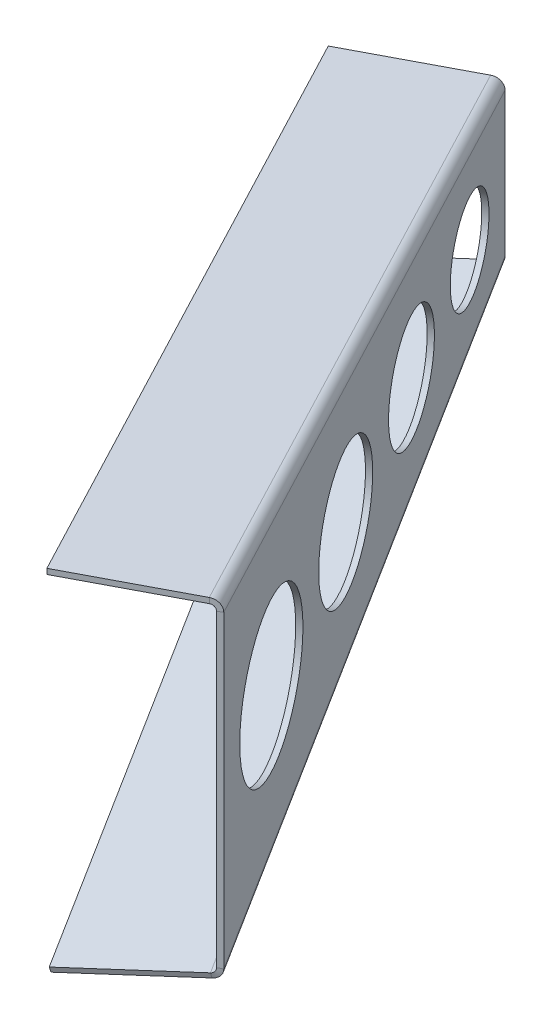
ISO-10303-21;
HEADER;
FILE_DESCRIPTION(('STEP AP214'),'2;1');
FILE_NAME('part.step','',(''),(''),'','','');
FILE_SCHEMA(('AUTOMOTIVE_DESIGN { 1 0 10303 214 1 1 1 1 }'));
ENDSEC;
DATA;
#1=APPLICATION_CONTEXT('core data for automotive mechanical design processes');
#2=APPLICATION_PROTOCOL_DEFINITION('international standard','automotive_design',2000,#1);
#3=PRODUCT_CONTEXT('',#1,'mechanical');
#4=PRODUCT('Part','Part','',(#3));
#5=PRODUCT_RELATED_PRODUCT_CATEGORY('part','',(#4));
#6=PRODUCT_DEFINITION_FORMATION('','',#4);
#7=PRODUCT_DEFINITION_CONTEXT('part definition',#1,'design');
#8=PRODUCT_DEFINITION('design','',#6,#7);
#9=PRODUCT_DEFINITION_SHAPE('','',#8);
#10=(LENGTH_UNIT() NAMED_UNIT(*) SI_UNIT(.MILLI.,.METRE.));
#11=(NAMED_UNIT(*) PLANE_ANGLE_UNIT() SI_UNIT($,.RADIAN.));
#12=(NAMED_UNIT(*) SI_UNIT($,.STERADIAN.) SOLID_ANGLE_UNIT());
#13=UNCERTAINTY_MEASURE_WITH_UNIT(LENGTH_MEASURE(1.E-05),#10,'distance_accuracy_value','');
#14=(GEOMETRIC_REPRESENTATION_CONTEXT(3) GLOBAL_UNCERTAINTY_ASSIGNED_CONTEXT((#13)) GLOBAL_UNIT_ASSIGNED_CONTEXT((#10,
#11,#12)) REPRESENTATION_CONTEXT('',''));
#15=CARTESIAN_POINT('',(0.,0.,0.));
#16=DIRECTION('',(0.,0.,1.));
#17=DIRECTION('',(1.,0.,0.));
#18=AXIS2_PLACEMENT_3D('',#15,#16,#17);
#19=CARTESIAN_POINT('',(2418.14339431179,-101.30553026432,-702.652532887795));
#20=DIRECTION('',(-0.465229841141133,0.,-0.885189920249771));
#21=DIRECTION('',(0.,1.,0.));
#22=AXIS2_PLACEMENT_3D('',#19,#20,#21);
#23=PLANE('',#22);
#24=DIRECTION('',(-0.885189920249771,0.,0.465229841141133));
#25=VECTOR('',#24,1.);
#26=CARTESIAN_POINT('',(2418.14339431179,-98.5287202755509,-702.652532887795));
#27=LINE('',#26,#25);
#28=CARTESIAN_POINT('',(2419.58235904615,-98.5287202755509,-703.408810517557));
#29=VERTEX_POINT('',#28);
#30=CARTESIAN_POINT('',(2418.14339431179,-98.5287202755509,-702.652532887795));
#31=VERTEX_POINT('',#30);
#32=EDGE_CURVE('E12',#29,#31,#27,.T.);
#33=ORIENTED_EDGE('',*,*,#32,.F.);
#34=DIRECTION('',(0.,1.,0.));
#35=VECTOR('',#34,1.);
#36=CARTESIAN_POINT('',(2419.58235904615,1.78294100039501E-12,-703.408810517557));
#37=LINE('',#36,#35);
#38=CARTESIAN_POINT('',(2419.58235904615,-4.87679999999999,-703.408810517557));
#39=VERTEX_POINT('',#38);
#40=EDGE_CURVE('E140',#29,#39,#37,.T.);
#41=ORIENTED_EDGE('',*,*,#40,.T.);
#42=DIRECTION('',(-0.885189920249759,0.,0.465229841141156));
#43=VECTOR('',#42,1.);
#44=CARTESIAN_POINT('',(2418.14339431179,-4.87679999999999,-702.652532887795));
#45=LINE('',#44,#43);
#46=CARTESIAN_POINT('',(2418.14339431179,-4.87679999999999,-702.652532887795));
#47=VERTEX_POINT('',#46);
#48=EDGE_CURVE('E93',#39,#47,#45,.T.);
#49=ORIENTED_EDGE('',*,*,#48,.T.);
#50=DIRECTION('',(0.,1.,0.));
#51=VECTOR('',#50,1.);
#52=CARTESIAN_POINT('',(2418.14339431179,-101.30553026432,-702.652532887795));
#53=LINE('',#52,#51);
#54=EDGE_CURVE('E142',#31,#47,#53,.T.);
#55=ORIENTED_EDGE('',*,*,#54,.F.);
#56=EDGE_LOOP('',(#33,#41,#49,#55));
#57=FACE_BOUND('',#56,.T.);
#58=ADVANCED_FACE('F82',(#57),#23,.F.);
#59=CARTESIAN_POINT('',(2416.70442957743,-4.87679999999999,-701.896255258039));
#60=DIRECTION('',(-0.46522984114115,0.,-0.885189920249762));
#61=DIRECTION('',(-0.885189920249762,0.,0.46522984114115));
#62=AXIS2_PLACEMENT_3D('',#59,#60,#61);
#63=PLANE('',#62);
#64=ORIENTED_EDGE('',*,*,#48,.F.);
#65=CARTESIAN_POINT('',(2416.70442957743,-4.87679999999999,-701.896255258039));
#66=DIRECTION('',(-0.465229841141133,0.,-0.885189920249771));
#67=DIRECTION('',(-0.885189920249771,0.,0.465229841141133));
#68=AXIS2_PLACEMENT_3D('',#65,#66,#67);
#69=CIRCLE('',#68,3.2512);
#70=CARTESIAN_POINT('',(2416.70442957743,-1.62559999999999,-701.896255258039));
#71=VERTEX_POINT('',#70);
#72=EDGE_CURVE('E351',#39,#71,#69,.F.);
#73=ORIENTED_EDGE('',*,*,#72,.T.);
#74=DIRECTION('',(0.,-1.,0.));
#75=VECTOR('',#74,1.);
#76=CARTESIAN_POINT('',(2416.70442957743,-3.25119999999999,-701.896255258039));
#77=LINE('',#76,#75);
#78=CARTESIAN_POINT('',(2416.70442957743,-3.25119999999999,-701.896255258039));
#79=VERTEX_POINT('',#78);
#80=EDGE_CURVE('E238',#71,#79,#77,.T.);
#81=ORIENTED_EDGE('',*,*,#80,.T.);
#82=CARTESIAN_POINT('',(2416.70442957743,-4.87679999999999,-701.896255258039));
#83=DIRECTION('',(0.46522984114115,0.,0.885189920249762));
#84=DIRECTION('',(0.885189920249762,0.,-0.46522984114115));
#85=AXIS2_PLACEMENT_3D('',#82,#83,#84);
#86=CIRCLE('',#85,1.6256);
#87=EDGE_CURVE('E316',#47,#79,#86,.T.);
#88=ORIENTED_EDGE('',*,*,#87,.F.);
#89=EDGE_LOOP('',(#64,#73,#81,#88));
#90=FACE_BOUND('',#89,.T.);
#91=ADVANCED_FACE('F435',(#90),#63,.F.);
#92=CARTESIAN_POINT('',(2384.41765835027,-3.25119999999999,-684.927275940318));
#93=DIRECTION('',(0.46522984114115,0.,0.885189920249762));
#94=DIRECTION('',(0.885189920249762,0.,-0.46522984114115));
#95=AXIS2_PLACEMENT_3D('',#92,#93,#94);
#96=PLANE('',#95);
#97=ORIENTED_EDGE('',*,*,#80,.F.);
#98=DIRECTION('',(0.885189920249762,0.,-0.46522984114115));
#99=VECTOR('',#98,1.);
#100=CARTESIAN_POINT('',(2384.41765835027,-1.62559999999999,-684.927275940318));
#101=LINE('',#100,#99);
#102=CARTESIAN_POINT('',(2384.41765835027,-1.62559999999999,-684.927275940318));
#103=VERTEX_POINT('',#102);
#104=EDGE_CURVE('E185',#103,#71,#101,.T.);
#105=ORIENTED_EDGE('',*,*,#104,.F.);
#106=DIRECTION('',(0.,-1.,0.));
#107=VECTOR('',#106,1.);
#108=CARTESIAN_POINT('',(2384.41765835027,-3.25119999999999,-684.927275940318));
#109=LINE('',#108,#107);
#110=CARTESIAN_POINT('',(2384.41765835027,-3.25119999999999,-684.927275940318));
#111=VERTEX_POINT('',#110);
#112=EDGE_CURVE('E234',#103,#111,#109,.T.);
#113=ORIENTED_EDGE('',*,*,#112,.T.);
#114=DIRECTION('',(0.885189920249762,0.,-0.46522984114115));
#115=VECTOR('',#114,1.);
#116=CARTESIAN_POINT('',(2384.41765835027,-3.25119999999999,-684.927275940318));
#117=LINE('',#116,#115);
#118=EDGE_CURVE('E297',#111,#79,#117,.T.);
#119=ORIENTED_EDGE('',*,*,#118,.T.);
#120=EDGE_LOOP('',(#97,#105,#113,#119));
#121=FACE_BOUND('',#120,.T.);
#122=ADVANCED_FACE('F380',(#121),#96,.T.);
#123=CARTESIAN_POINT('',(2289.88295463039,-3.25119999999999,-864.797867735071));
#124=DIRECTION('',(-0.885189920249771,0.,0.465229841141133));
#125=DIRECTION('',(0.465229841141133,0.,0.885189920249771));
#126=AXIS2_PLACEMENT_3D('',#123,#124,#125);
#127=PLANE('',#126);
#128=ORIENTED_EDGE('',*,*,#112,.F.);
#129=DIRECTION('',(0.465229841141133,0.,0.885189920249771));
#130=VECTOR('',#129,1.);
#131=CARTESIAN_POINT('',(2289.88295463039,-1.62559999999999,-864.797867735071));
#132=LINE('',#131,#130);
#133=CARTESIAN_POINT('',(2289.88295463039,-1.62559999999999,-864.797867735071));
#134=VERTEX_POINT('',#133);
#135=EDGE_CURVE('E196',#134,#103,#132,.T.);
#136=ORIENTED_EDGE('',*,*,#135,.F.);
#137=DIRECTION('',(0.,-1.,0.));
#138=VECTOR('',#137,1.);
#139=CARTESIAN_POINT('',(2289.88295463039,-3.25119999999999,-864.797867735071));
#140=LINE('',#139,#138);
#141=CARTESIAN_POINT('',(2289.88295463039,-3.25119999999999,-864.797867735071));
#142=VERTEX_POINT('',#141);
#143=EDGE_CURVE('E230',#134,#142,#140,.T.);
#144=ORIENTED_EDGE('',*,*,#143,.T.);
#145=DIRECTION('',(0.465229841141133,0.,0.885189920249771));
#146=VECTOR('',#145,1.);
#147=CARTESIAN_POINT('',(2289.88295463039,-3.25119999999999,-864.797867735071));
#148=LINE('',#147,#146);
#149=EDGE_CURVE('E293',#142,#111,#148,.T.);
#150=ORIENTED_EDGE('',*,*,#149,.T.);
#151=EDGE_LOOP('',(#128,#136,#144,#150));
#152=FACE_BOUND('',#151,.T.);
#153=ADVANCED_FACE('F375',(#152),#127,.T.);
#154=CARTESIAN_POINT('',(2325.04765532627,-3.25119999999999,-883.279402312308));
#155=DIRECTION('',(-0.46522984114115,0.,-0.885189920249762));
#156=DIRECTION('',(-0.885189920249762,0.,0.46522984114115));
#157=AXIS2_PLACEMENT_3D('',#154,#155,#156);
#158=PLANE('',#157);
#159=ORIENTED_EDGE('',*,*,#143,.F.);
#160=DIRECTION('',(-0.885189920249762,0.,0.46522984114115));
#161=VECTOR('',#160,1.);
#162=CARTESIAN_POINT('',(2325.04765532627,-1.62559999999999,-883.279402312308));
#163=LINE('',#162,#161);
#164=CARTESIAN_POINT('',(2322.16972585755,-1.62559999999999,-881.766847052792));
#165=VERTEX_POINT('',#164);
#166=EDGE_CURVE('E180',#165,#134,#163,.T.);
#167=ORIENTED_EDGE('',*,*,#166,.F.);
#168=DIRECTION('',(0.,-1.,0.));
#169=VECTOR('',#168,1.);
#170=CARTESIAN_POINT('',(2322.16972585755,-3.25119999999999,-881.766847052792));
#171=LINE('',#170,#169);
#172=CARTESIAN_POINT('',(2322.16972585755,-3.25119999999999,-881.766847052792));
#173=VERTEX_POINT('',#172);
#174=EDGE_CURVE('E226',#165,#173,#171,.T.);
#175=ORIENTED_EDGE('',*,*,#174,.T.);
#176=DIRECTION('',(-0.885189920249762,0.,0.46522984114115));
#177=VECTOR('',#176,1.);
#178=CARTESIAN_POINT('',(2325.04765532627,-3.25119999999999,-883.279402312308));
#179=LINE('',#178,#177);
#180=EDGE_CURVE('E301',#173,#142,#179,.T.);
#181=ORIENTED_EDGE('',*,*,#180,.T.);
#182=EDGE_LOOP('',(#159,#167,#175,#181));
#183=FACE_BOUND('',#182,.T.);
#184=ADVANCED_FACE('F369',(#183),#158,.T.);
#185=CARTESIAN_POINT('',(2322.16972585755,-4.87679999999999,-881.766847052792));
#186=DIRECTION('',(0.46522984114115,0.,0.885189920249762));
#187=DIRECTION('',(0.885189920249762,0.,-0.46522984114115));
#188=AXIS2_PLACEMENT_3D('',#185,#186,#187);
#189=PLANE('',#188);
#190=ORIENTED_EDGE('',*,*,#174,.F.);
#191=CARTESIAN_POINT('',(2322.16972585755,-4.87679999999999,-881.766847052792));
#192=DIRECTION('',(-0.465229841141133,0.,-0.885189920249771));
#193=DIRECTION('',(-0.885189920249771,0.,0.465229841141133));
#194=AXIS2_PLACEMENT_3D('',#191,#192,#193);
#195=CIRCLE('',#194,3.2512);
#196=CARTESIAN_POINT('',(2325.04765532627,-4.87679999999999,-883.27940231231));
#197=VERTEX_POINT('',#196);
#198=EDGE_CURVE('E187',#165,#197,#195,.T.);
#199=ORIENTED_EDGE('',*,*,#198,.T.);
#200=DIRECTION('',(-0.885189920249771,0.,0.465229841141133));
#201=VECTOR('',#200,1.);
#202=CARTESIAN_POINT('',(2323.60869059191,-4.87679999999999,-882.523124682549));
#203=LINE('',#202,#201);
#204=CARTESIAN_POINT('',(2323.60869059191,-4.87679999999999,-882.523124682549));
#205=VERTEX_POINT('',#204);
#206=EDGE_CURVE('E223',#197,#205,#203,.T.);
#207=ORIENTED_EDGE('',*,*,#206,.T.);
#208=CARTESIAN_POINT('',(2322.16972585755,-4.87679999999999,-881.766847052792));
#209=DIRECTION('',(-0.46522984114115,0.,-0.885189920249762));
#210=DIRECTION('',(-0.885189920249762,0.,0.46522984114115));
#211=AXIS2_PLACEMENT_3D('',#208,#209,#210);
#212=CIRCLE('',#211,1.6256);
#213=EDGE_CURVE('E312',#173,#205,#212,.T.);
#214=ORIENTED_EDGE('',*,*,#213,.F.);
#215=EDGE_LOOP('',(#190,#199,#207,#214));
#216=FACE_BOUND('',#215,.T.);
#217=ADVANCED_FACE('F363',(#216),#189,.F.);
#218=CARTESIAN_POINT('',(2323.60869059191,-1.62559999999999,-882.523124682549));
#219=DIRECTION('',(0.465229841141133,0.,0.885189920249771));
#220=DIRECTION('',(0.,-1.,0.));
#221=AXIS2_PLACEMENT_3D('',#218,#219,#220);
#222=PLANE('',#221);
#223=ORIENTED_EDGE('',*,*,#206,.F.);
#224=DIRECTION('',(0.,1.,0.));
#225=VECTOR('',#224,1.);
#226=CARTESIAN_POINT('',(2325.04765532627,1.78294100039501E-12,-883.27940231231));
#227=LINE('',#226,#225);
#228=CARTESIAN_POINT('',(2325.04765532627,-48.3576055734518,-883.27940231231));
#229=VERTEX_POINT('',#228);
#230=EDGE_CURVE('E172',#197,#229,#227,.F.);
#231=ORIENTED_EDGE('',*,*,#230,.T.);
#232=DIRECTION('',(-0.885189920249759,0.,0.465229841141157));
#233=VECTOR('',#232,1.);
#234=CARTESIAN_POINT('',(2323.60869059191,-48.3576055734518,-882.523124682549));
#235=LINE('',#234,#233);
#236=CARTESIAN_POINT('',(2323.60869059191,-48.3576055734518,-882.523124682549));
#237=VERTEX_POINT('',#236);
#238=EDGE_CURVE('E219',#229,#237,#235,.T.);
#239=ORIENTED_EDGE('',*,*,#238,.T.);
#240=DIRECTION('',(0.,-1.,0.));
#241=VECTOR('',#240,1.);
#242=CARTESIAN_POINT('',(2323.60869059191,-1.62559999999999,-882.523124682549));
#243=LINE('',#242,#241);
#244=EDGE_CURVE('E271',#205,#237,#243,.T.);
#245=ORIENTED_EDGE('',*,*,#244,.F.);
#246=EDGE_LOOP('',(#223,#231,#239,#245));
#247=FACE_BOUND('',#246,.T.);
#248=ADVANCED_FACE('F482',(#247),#222,.F.);
#249=CARTESIAN_POINT('',(2322.16972585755,-50.0320225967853,-881.766847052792));
#250=CARTESIAN_POINT('',(2322.10929759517,-50.5580913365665,-881.881823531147));
#251=CARTESIAN_POINT('',(2322.04886933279,-51.0841600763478,-881.996800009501));
#252=CARTESIAN_POINT('',(2321.98844107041,-51.610228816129,-882.111776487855));
#253=CARTESIAN_POINT('',(2319.29179638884,-50.0320225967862,-880.254291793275));
#254=CARTESIAN_POINT('',(2318.27205830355,-50.5580913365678,-879.865083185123));
#255=CARTESIAN_POINT('',(2317.25232021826,-51.0841600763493,-879.475874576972));
#256=CARTESIAN_POINT('',(2316.23258213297,-51.6102288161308,-879.08666596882));
#257=CARTESIAN_POINT('',(2319.29179638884,-46.6831885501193,-880.254291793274));
#258=CARTESIAN_POINT('',(2318.39291482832,-46.1571198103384,-879.635130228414));
#259=CARTESIAN_POINT('',(2317.49403326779,-45.6310510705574,-879.015968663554));
#260=CARTESIAN_POINT('',(2316.59515170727,-45.1049823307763,-878.396807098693));
#261=CARTESIAN_POINT('',(2322.16972585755,-46.6831885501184,-881.766847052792));
#262=CARTESIAN_POINT('',(2322.23015411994,-46.1571198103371,-881.651870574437));
#263=CARTESIAN_POINT('',(2322.29058238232,-45.6310510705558,-881.536894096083));
#264=CARTESIAN_POINT('',(2322.3510106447,-45.1049823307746,-881.421917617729));
#265=CARTESIAN_POINT('',(2325.04765532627,-46.6831885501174,-883.27940231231));
#266=CARTESIAN_POINT('',(2326.06739341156,-46.1571198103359,-883.668610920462));
#267=CARTESIAN_POINT('',(2327.08713149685,-45.6310510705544,-884.057819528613));
#268=CARTESIAN_POINT('',(2328.10686958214,-45.1049823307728,-884.447028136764));
#269=CARTESIAN_POINT('',(2325.04765532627,-50.0320225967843,-883.27940231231));
#270=CARTESIAN_POINT('',(2325.94653688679,-50.5580913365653,-883.898563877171));
#271=CARTESIAN_POINT('',(2326.84541844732,-51.0841600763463,-884.517725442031));
#272=CARTESIAN_POINT('',(2327.74430000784,-51.6102288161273,-885.136887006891));
#273=CARTESIAN_POINT('',(2322.16972585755,-50.0320225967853,-881.766847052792));
#274=CARTESIAN_POINT('',(2322.10929759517,-50.5580913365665,-881.881823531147));
#275=CARTESIAN_POINT('',(2322.04886933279,-51.0841600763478,-881.996800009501));
#276=CARTESIAN_POINT('',(2321.98844107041,-51.610228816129,-882.111776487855));
#277=(BOUNDED_SURFACE() B_SPLINE_SURFACE(3,3,((#249,#250,#251,#252),(#253,#254,#255,#256),(#257,
#258,#259,#260),(#261,#262,#263,#264),(#265,#266,#267,#268),(#269,#270,#271,#272),(#273,#274,
#275,#276)),.UNSPECIFIED.,.T.,.F.,.F.) B_SPLINE_SURFACE_WITH_KNOTS((4,3,4),(4,4),(0.,0.5,1.),
(0.,1.),.UNSPECIFIED.) GEOMETRIC_REPRESENTATION_ITEM() RATIONAL_B_SPLINE_SURFACE(((1.,1.,1.,1.),
(0.333333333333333,0.333333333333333,0.333333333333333,0.333333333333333),(0.333333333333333,
0.333333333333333,0.333333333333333,0.333333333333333),(1.,1.,1.,1.),(0.333333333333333,
0.333333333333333,0.333333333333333,0.333333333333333),(0.333333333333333,0.333333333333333,
0.333333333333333,0.333333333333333),(1.,1.,1.,1.))) REPRESENTATION_ITEM('') SURFACE());
#278=CARTESIAN_POINT('',(2322.16972585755,-48.3576055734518,-881.766847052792));
#279=DIRECTION('',(-0.461926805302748,0.118950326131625,-0.878905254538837));
#280=DIRECTION('',(-0.055339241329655,-0.992900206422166,-0.105293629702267));
#281=AXIS2_PLACEMENT_3D('',#278,#279,#280);
#282=ELLIPSE('',#281,3.27588132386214,3.2512);
#283=CARTESIAN_POINT('',(2322.45329086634,-51.5679535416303,-882.350366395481));
#284=VERTEX_POINT('',#283);
#285=EDGE_CURVE('E158',#229,#284,#282,.T.);
#286=DIRECTION('',(-0.0321839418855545,0.95822700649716,0.28419218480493));
#287=VECTOR('',#286,1.);
#288=CARTESIAN_POINT('',(2322.40097265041,-50.0102597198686,-881.888383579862));
#289=LINE('',#288,#287);
#290=CARTESIAN_POINT('',(2322.40097265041,-50.0102597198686,-881.888383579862));
#291=VERTEX_POINT('',#290);
#292=EDGE_CURVE('E215',#284,#291,#289,.T.);
#293=CARTESIAN_POINT('',(2322.16972585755,-48.3576055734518,-881.766847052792));
#294=DIRECTION('',(-0.465229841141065,0.,-0.885189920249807));
#295=DIRECTION('',(2.76738992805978E-13,-1.,-1.45445892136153E-13));
#296=AXIS2_PLACEMENT_3D('',#293,#294,#295);
#297=ELLIPSE('',#296,1.67441702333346,1.6256);
#298=EDGE_CURVE('E308',#237,#291,#297,.T.);
#299=ORIENTED_EDGE('',*,*,#238,.F.);
#300=ORIENTED_EDGE('',*,*,#285,.T.);
#301=ORIENTED_EDGE('',*,*,#292,.T.);
#302=ORIENTED_EDGE('',*,*,#298,.F.);
#303=EDGE_LOOP('',(#299,#300,#301,#302));
#304=FACE_BOUND('',#303,.T.);
#305=ADVANCED_FACE('F422',(#304),#277,.F.);
#306=CARTESIAN_POINT('',(2290.34747036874,-56.083160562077,-865.04200357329));
#307=DIRECTION('',(-0.48666091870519,0.233332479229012,-0.841853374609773));
#308=DIRECTION('',(0.872997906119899,0.165399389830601,-0.458822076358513));
#309=AXIS2_PLACEMENT_3D('',#306,#307,#308);
#310=PLANE('',#309);
#311=ORIENTED_EDGE('',*,*,#292,.F.);
#312=DIRECTION('',(0.872997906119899,0.165399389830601,-0.458822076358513));
#313=VECTOR('',#312,1.);
#314=CARTESIAN_POINT('',(2290.39978858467,-57.6408543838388,-865.503986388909));
#315=LINE('',#314,#313);
#316=CARTESIAN_POINT('',(2290.39978858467,-57.6408543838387,-865.503986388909));
#317=VERTEX_POINT('',#316);
#318=EDGE_CURVE('E331',#317,#284,#315,.T.);
#319=ORIENTED_EDGE('',*,*,#318,.F.);
#320=DIRECTION('',(-0.0321839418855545,0.95822700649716,0.28419218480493));
#321=VECTOR('',#320,1.);
#322=CARTESIAN_POINT('',(2290.34747036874,-56.083160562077,-865.04200357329));
#323=LINE('',#322,#321);
#324=CARTESIAN_POINT('',(2290.34747036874,-56.083160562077,-865.04200357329));
#325=VERTEX_POINT('',#324);
#326=EDGE_CURVE('E211',#317,#325,#323,.T.);
#327=ORIENTED_EDGE('',*,*,#326,.T.);
#328=DIRECTION('',(0.872997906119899,0.165399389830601,-0.458822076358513));
#329=VECTOR('',#328,1.);
#330=CARTESIAN_POINT('',(2290.34747036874,-56.083160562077,-865.04200357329));
#331=LINE('',#330,#329);
#332=EDGE_CURVE('E263',#325,#291,#331,.T.);
#333=ORIENTED_EDGE('',*,*,#332,.T.);
#334=EDGE_LOOP('',(#311,#319,#327,#333));
#335=FACE_BOUND('',#334,.T.);
#336=ADVANCED_FACE('F406',(#335),#310,.T.);
#337=CARTESIAN_POINT('',(2384.88217408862,-106.254275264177,-685.171411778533));
#338=DIRECTION('',(-0.891606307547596,-0.156018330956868,0.425084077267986));
#339=DIRECTION('',(-0.451666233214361,0.23970666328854,-0.859382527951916));
#340=AXIS2_PLACEMENT_3D('',#337,#338,#339);
#341=PLANE('',#340);
#342=ORIENTED_EDGE('',*,*,#326,.F.);
#343=DIRECTION('',(-0.451666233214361,0.23970666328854,-0.859382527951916));
#344=VECTOR('',#343,1.);
#345=CARTESIAN_POINT('',(2384.93449230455,-107.811969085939,-685.633394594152));
#346=LINE('',#345,#344);
#347=CARTESIAN_POINT('',(2384.93449230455,-107.811969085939,-685.633394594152));
#348=VERTEX_POINT('',#347);
#349=EDGE_CURVE('E327',#348,#317,#346,.T.);
#350=ORIENTED_EDGE('',*,*,#349,.F.);
#351=DIRECTION('',(-0.0321839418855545,0.95822700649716,0.28419218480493));
#352=VECTOR('',#351,1.);
#353=CARTESIAN_POINT('',(2384.88217408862,-106.254275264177,-685.171411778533));
#354=LINE('',#353,#352);
#355=CARTESIAN_POINT('',(2384.88217408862,-106.254275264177,-685.171411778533));
#356=VERTEX_POINT('',#355);
#357=EDGE_CURVE('E207',#348,#356,#354,.T.);
#358=ORIENTED_EDGE('',*,*,#357,.T.);
#359=DIRECTION('',(-0.451666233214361,0.23970666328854,-0.859382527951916));
#360=VECTOR('',#359,1.);
#361=CARTESIAN_POINT('',(2384.88217408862,-106.254275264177,-685.171411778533));
#362=LINE('',#361,#360);
#363=EDGE_CURVE('E259',#356,#325,#362,.T.);
#364=ORIENTED_EDGE('',*,*,#363,.T.);
#365=EDGE_LOOP('',(#342,#350,#358,#364));
#366=FACE_BOUND('',#365,.T.);
#367=ADVANCED_FACE('F414',(#366),#341,.T.);
#368=CARTESIAN_POINT('',(2419.58235904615,-99.6799302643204,-703.408810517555));
#369=DIRECTION('',(0.486660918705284,-0.233332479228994,0.841853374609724));
#370=DIRECTION('',(-0.872997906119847,-0.165399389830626,0.458822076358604));
#371=AXIS2_PLACEMENT_3D('',#368,#369,#370);
#372=PLANE('',#371);
#373=ORIENTED_EDGE('',*,*,#357,.F.);
#374=DIRECTION('',(-0.872997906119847,-0.165399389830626,0.458822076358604));
#375=VECTOR('',#374,1.);
#376=CARTESIAN_POINT('',(2419.63467726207,-101.237624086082,-703.870793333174));
#377=LINE('',#376,#375);
#378=CARTESIAN_POINT('',(2416.98799458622,-101.73906824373,-702.479774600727));
#379=VERTEX_POINT('',#378);
#380=EDGE_CURVE('E335',#379,#348,#377,.T.);
#381=ORIENTED_EDGE('',*,*,#380,.F.);
#382=DIRECTION('',(-0.0321839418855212,0.958227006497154,0.284192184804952));
#383=VECTOR('',#382,1.);
#384=CARTESIAN_POINT('',(2416.93567637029,-100.181374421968,-702.017791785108));
#385=LINE('',#384,#383);
#386=CARTESIAN_POINT('',(2416.93567637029,-100.181374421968,-702.017791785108));
#387=VERTEX_POINT('',#386);
#388=EDGE_CURVE('E86',#379,#387,#385,.T.);
#389=ORIENTED_EDGE('',*,*,#388,.T.);
#390=DIRECTION('',(-0.872997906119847,-0.165399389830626,0.458822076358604));
#391=VECTOR('',#390,1.);
#392=CARTESIAN_POINT('',(2419.58235904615,-99.6799302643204,-703.408810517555));
#393=LINE('',#392,#391);
#394=EDGE_CURVE('E267',#387,#356,#393,.T.);
#395=ORIENTED_EDGE('',*,*,#394,.T.);
#396=EDGE_LOOP('',(#373,#381,#389,#395));
#397=FACE_BOUND('',#396,.T.);
#398=ADVANCED_FACE('F416',(#397),#372,.T.);
#399=CARTESIAN_POINT('',(2402.15339542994,-47.2224880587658,-733.076604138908));
#400=DIRECTION('',(0.885189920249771,0.,-0.465229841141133));
#401=DIRECTION('',(-0.465229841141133,0.,-0.885189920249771));
#402=AXIS2_PLACEMENT_3D('',#399,#400,#401);
#403=CYLINDRICAL_SURFACE('',#402,22.7984440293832);
#404=CARTESIAN_POINT('',(2402.15339542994,-47.2224880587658,-733.076604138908));
#405=DIRECTION('',(0.885189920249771,0.,-0.465229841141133));
#406=DIRECTION('',(-0.465229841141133,0.,-0.885189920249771));
#407=AXIS2_PLACEMENT_3D('',#404,#405,#406);
#408=CIRCLE('',#407,22.7984440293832);
#409=CARTESIAN_POINT('',(2391.54687893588,-47.2224880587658,-753.257556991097));
#410=VERTEX_POINT('',#409);
#411=EDGE_CURVE('E289',#410,#410,#408,.F.);
#412=ORIENTED_EDGE('',*,*,#411,.T.);
#413=EDGE_LOOP('',(#412));
#414=FACE_BOUND('',#413,.T.);
#415=CARTESIAN_POINT('',(2403.5923601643,-47.2224880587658,-733.832881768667));
#416=DIRECTION('',(0.885189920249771,0.,-0.465229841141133));
#417=DIRECTION('',(-0.465229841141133,0.,-0.885189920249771));
#418=AXIS2_PLACEMENT_3D('',#415,#416,#417);
#419=CIRCLE('',#418,22.7984440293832);
#420=CARTESIAN_POINT('',(2392.98584367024,-47.2224880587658,-754.013834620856));
#421=VERTEX_POINT('',#420);
#422=EDGE_CURVE('E191',#421,#421,#419,.F.);
#423=ORIENTED_EDGE('',*,*,#422,.F.);
#424=EDGE_LOOP('',(#423));
#425=FACE_BOUND('',#424,.T.);
#426=ADVANCED_FACE('F447',(#414,#425),#403,.F.);
#427=CARTESIAN_POINT('',(2377.16746087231,-40.5922658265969,-780.617186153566));
#428=DIRECTION('',(0.885189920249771,0.,-0.465229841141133));
#429=DIRECTION('',(-0.465229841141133,0.,-0.885189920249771));
#430=AXIS2_PLACEMENT_3D('',#427,#428,#429);
#431=CYLINDRICAL_SURFACE('',#430,19.4833329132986);
#432=CARTESIAN_POINT('',(2377.16746087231,-40.5922658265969,-780.617186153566));
#433=DIRECTION('',(0.885189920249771,0.,-0.465229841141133));
#434=DIRECTION('',(-0.465229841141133,0.,-0.885189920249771));
#435=AXIS2_PLACEMENT_3D('',#432,#433,#434);
#436=CIRCLE('',#435,19.4833329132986);
#437=CARTESIAN_POINT('',(2368.10323299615,-40.5922658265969,-797.863636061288));
#438=VERTEX_POINT('',#437);
#439=EDGE_CURVE('E285',#438,#438,#436,.F.);
#440=ORIENTED_EDGE('',*,*,#439,.T.);
#441=EDGE_LOOP('',(#440));
#442=FACE_BOUND('',#441,.T.);
#443=CARTESIAN_POINT('',(2378.60642560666,-40.5922658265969,-781.373463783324));
#444=DIRECTION('',(0.885189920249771,0.,-0.465229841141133));
#445=DIRECTION('',(-0.465229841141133,0.,-0.885189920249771));
#446=AXIS2_PLACEMENT_3D('',#443,#444,#445);
#447=CIRCLE('',#446,19.4833329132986);
#448=CARTESIAN_POINT('',(2369.54219773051,-40.5922658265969,-798.619913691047));
#449=VERTEX_POINT('',#448);
#450=EDGE_CURVE('E195',#449,#449,#447,.F.);
#451=ORIENTED_EDGE('',*,*,#450,.F.);
#452=EDGE_LOOP('',(#451));
#453=FACE_BOUND('',#452,.T.);
#454=ADVANCED_FACE('F455',(#442,#453),#431,.F.);
#455=CARTESIAN_POINT('',(2355.06614813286,-34.7275016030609,-822.669216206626));
#456=DIRECTION('',(0.885189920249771,0.,-0.465229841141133));
#457=DIRECTION('',(-0.465229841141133,0.,-0.885189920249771));
#458=AXIS2_PLACEMENT_3D('',#455,#456,#457);
#459=CYLINDRICAL_SURFACE('',#458,16.5509508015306);
#460=CARTESIAN_POINT('',(2355.06614813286,-34.7275016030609,-822.669216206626));
#461=DIRECTION('',(0.885189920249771,0.,-0.465229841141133));
#462=DIRECTION('',(-0.465229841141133,0.,-0.885189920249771));
#463=AXIS2_PLACEMENT_3D('',#460,#461,#462);
#464=CIRCLE('',#463,16.5509508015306);
#465=CARTESIAN_POINT('',(2347.36615192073,-34.7275016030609,-837.319951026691));
#466=VERTEX_POINT('',#465);
#467=EDGE_CURVE('E281',#466,#466,#464,.F.);
#468=ORIENTED_EDGE('',*,*,#467,.T.);
#469=EDGE_LOOP('',(#468));
#470=FACE_BOUND('',#469,.T.);
#471=CARTESIAN_POINT('',(2356.50511286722,-34.7275016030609,-823.425493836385));
#472=DIRECTION('',(0.885189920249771,0.,-0.465229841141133));
#473=DIRECTION('',(-0.465229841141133,0.,-0.885189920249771));
#474=AXIS2_PLACEMENT_3D('',#471,#472,#473);
#475=CIRCLE('',#474,16.5509508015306);
#476=CARTESIAN_POINT('',(2348.80511665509,-34.7275016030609,-838.07622865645));
#477=VERTEX_POINT('',#476);
#478=EDGE_CURVE('E200',#477,#477,#475,.F.);
#479=ORIENTED_EDGE('',*,*,#478,.F.);
#480=EDGE_LOOP('',(#479));
#481=FACE_BOUND('',#480,.T.);
#482=ADVANCED_FACE('F458',(#470,#481),#459,.F.);
#483=CARTESIAN_POINT('',(2335.51642812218,-29.5398233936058,-859.866346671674));
#484=DIRECTION('',(0.885189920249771,0.,-0.465229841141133));
#485=DIRECTION('',(-0.465229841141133,0.,-0.885189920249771));
#486=AXIS2_PLACEMENT_3D('',#483,#484,#485);
#487=CYLINDRICAL_SURFACE('',#486,13.9571116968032);
#488=CARTESIAN_POINT('',(2335.51642812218,-29.5398233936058,-859.866346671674));
#489=DIRECTION('',(0.885189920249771,0.,-0.465229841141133));
#490=DIRECTION('',(-0.465229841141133,0.,-0.885189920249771));
#491=AXIS2_PLACEMENT_3D('',#488,#489,#490);
#492=CIRCLE('',#491,13.9571116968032);
#493=CARTESIAN_POINT('',(2329.02316326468,-29.5398233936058,-872.221041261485));
#494=VERTEX_POINT('',#493);
#495=EDGE_CURVE('E277',#494,#494,#492,.F.);
#496=ORIENTED_EDGE('',*,*,#495,.T.);
#497=EDGE_LOOP('',(#496));
#498=FACE_BOUND('',#497,.T.);
#499=CARTESIAN_POINT('',(2336.95539285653,-29.5398233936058,-860.622624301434));
#500=DIRECTION('',(0.885189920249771,0.,-0.465229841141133));
#501=DIRECTION('',(-0.465229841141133,0.,-0.885189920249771));
#502=AXIS2_PLACEMENT_3D('',#499,#500,#501);
#503=CIRCLE('',#502,13.9571116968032);
#504=CARTESIAN_POINT('',(2330.46212799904,-29.5398233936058,-872.977318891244));
#505=VERTEX_POINT('',#504);
#506=EDGE_CURVE('E173',#505,#505,#503,.F.);
#507=ORIENTED_EDGE('',*,*,#506,.F.);
#508=EDGE_LOOP('',(#507));
#509=FACE_BOUND('',#508,.T.);
#510=ADVANCED_FACE('F84',(#498,#509),#487,.F.);
#511=CARTESIAN_POINT('',(2416.70442957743,-100.203137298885,-701.896255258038));
#512=CARTESIAN_POINT('',(2416.64400131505,-100.729206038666,-702.011231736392));
#513=CARTESIAN_POINT('',(2416.58357305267,-101.255274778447,-702.126208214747));
#514=CARTESIAN_POINT('',(2416.52314479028,-101.781343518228,-702.241184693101));
#515=CARTESIAN_POINT('',(2419.58235904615,-100.203137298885,-703.408810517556));
#516=CARTESIAN_POINT('',(2420.48124060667,-100.729206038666,-704.027972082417));
#517=CARTESIAN_POINT('',(2421.38012216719,-101.255274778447,-704.647133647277));
#518=CARTESIAN_POINT('',(2422.27900372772,-101.781343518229,-705.266295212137));
#519=CARTESIAN_POINT('',(2419.58235904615,-96.8543032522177,-703.408810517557));
#520=CARTESIAN_POINT('',(2420.60209713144,-96.3282345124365,-703.798019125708));
#521=CARTESIAN_POINT('',(2421.62183521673,-95.8021657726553,-704.18722773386));
#522=CARTESIAN_POINT('',(2422.64157330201,-95.2760970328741,-704.576436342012));
#523=CARTESIAN_POINT('',(2416.70442957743,-96.8543032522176,-701.896255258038));
#524=CARTESIAN_POINT('',(2416.76485783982,-96.3282345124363,-701.781278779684));
#525=CARTESIAN_POINT('',(2416.8252861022,-95.802165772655,-701.66630230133));
#526=CARTESIAN_POINT('',(2416.88571436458,-95.2760970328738,-701.551325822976));
#527=CARTESIAN_POINT('',(2413.82650010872,-96.8543032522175,-700.38369999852));
#528=CARTESIAN_POINT('',(2412.92761854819,-96.3282345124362,-699.76453843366));
#529=CARTESIAN_POINT('',(2412.02873698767,-95.8021657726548,-699.1453768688));
#530=CARTESIAN_POINT('',(2411.12985542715,-95.2760970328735,-698.526215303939));
#531=CARTESIAN_POINT('',(2413.82650010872,-100.203137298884,-700.38369999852));
#532=CARTESIAN_POINT('',(2412.80676202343,-100.729206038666,-699.994491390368));
#533=CARTESIAN_POINT('',(2411.78702393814,-101.255274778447,-699.605282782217));
#534=CARTESIAN_POINT('',(2410.76728585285,-101.781343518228,-699.216074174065));
#535=CARTESIAN_POINT('',(2416.70442957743,-100.203137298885,-701.896255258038));
#536=CARTESIAN_POINT('',(2416.64400131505,-100.729206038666,-702.011231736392));
#537=CARTESIAN_POINT('',(2416.58357305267,-101.255274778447,-702.126208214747));
#538=CARTESIAN_POINT('',(2416.52314479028,-101.781343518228,-702.241184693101));
#539=(BOUNDED_SURFACE() B_SPLINE_SURFACE(3,3,((#511,#512,#513,#514),(#515,#516,#517,#518),(#519,
#520,#521,#522),(#523,#524,#525,#526),(#527,#528,#529,#530),(#531,#532,#533,#534),(#535,#536,
#537,#538)),.UNSPECIFIED.,.T.,.F.,.F.) B_SPLINE_SURFACE_WITH_KNOTS((4,3,4),(4,4),(0.,0.5,1.),
(0.,1.),.UNSPECIFIED.) GEOMETRIC_REPRESENTATION_ITEM() RATIONAL_B_SPLINE_SURFACE(((1.,1.,1.,1.),
(0.333333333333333,0.333333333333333,0.333333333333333,0.333333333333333),(0.333333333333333,
0.333333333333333,0.333333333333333,0.333333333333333),(1.,1.,1.,1.),(0.333333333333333,
0.333333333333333,0.333333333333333,0.333333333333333),(0.333333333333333,0.333333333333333,
0.333333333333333,0.333333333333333),(1.,1.,1.,1.))) REPRESENTATION_ITEM('') SURFACE());
#540=CARTESIAN_POINT('',(2416.70442957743,-98.528720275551,-701.896255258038));
#541=DIRECTION('',(0.461926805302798,-0.118950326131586,0.878905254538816));
#542=DIRECTION('',(-0.055339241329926,-0.992900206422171,-0.10529362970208));
#543=AXIS2_PLACEMENT_3D('',#540,#541,#542);
#544=ELLIPSE('',#543,3.27588132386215,3.2512);
#545=EDGE_CURVE('E155',#379,#29,#544,.T.);
#546=CARTESIAN_POINT('',(2416.70442957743,-98.528720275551,-701.896255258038));
#547=DIRECTION('',(0.465229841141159,0.,0.885189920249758));
#548=DIRECTION('',(-1.03520882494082E-13,-1.,0.));
#549=AXIS2_PLACEMENT_3D('',#546,#547,#548);
#550=ELLIPSE('',#549,1.67441702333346,1.6256);
#551=EDGE_CURVE('E305',#387,#31,#550,.T.);
#552=ORIENTED_EDGE('',*,*,#545,.T.);
#553=ORIENTED_EDGE('',*,*,#32,.T.);
#554=ORIENTED_EDGE('',*,*,#551,.F.);
#555=ORIENTED_EDGE('',*,*,#388,.F.);
#556=EDGE_LOOP('',(#552,#553,#554,#555));
#557=FACE_BOUND('',#556,.T.);
#558=ADVANCED_FACE('F176',(#557),#539,.F.);
#559=CARTESIAN_POINT('',(12.0641081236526,-357.564528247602,-106.529065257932));
#560=DIRECTION('',(0.0321839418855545,-0.95822700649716,-0.28419218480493));
#561=DIRECTION('',(0.,0.284339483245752,-0.958723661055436));
#562=AXIS2_PLACEMENT_3D('',#559,#560,#561);
#563=PLANE('',#562);
#564=ORIENTED_EDGE('',*,*,#394,.F.);
#565=DIRECTION('',(-0.451666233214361,0.23970666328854,-0.859382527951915));
#566=VECTOR('',#565,1.);
#567=CARTESIAN_POINT('',(2322.37619934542,-49.9971121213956,-881.935519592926));
#568=LINE('',#567,#566);
#569=EDGE_CURVE('E255',#387,#291,#568,.T.);
#570=ORIENTED_EDGE('',*,*,#569,.T.);
#571=ORIENTED_EDGE('',*,*,#332,.F.);
#572=ORIENTED_EDGE('',*,*,#363,.F.);
#573=EDGE_LOOP('',(#564,#570,#571,#572));
#574=FACE_BOUND('',#573,.T.);
#575=ADVANCED_FACE('F412',(#574),#563,.F.);
#576=CARTESIAN_POINT('',(2184.12742121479,1.78176789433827E-12,-1147.91326692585));
#577=DIRECTION('',(0.885189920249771,0.,-0.465229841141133));
#578=DIRECTION('',(-0.465229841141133,0.,-0.885189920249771));
#579=AXIS2_PLACEMENT_3D('',#576,#577,#578);
#580=PLANE('',#579);
#581=ORIENTED_EDGE('',*,*,#411,.F.);
#582=EDGE_LOOP('',(#581));
#583=FACE_BOUND('',#582,.T.);
#584=ORIENTED_EDGE('',*,*,#439,.F.);
#585=EDGE_LOOP('',(#584));
#586=FACE_BOUND('',#585,.T.);
#587=ORIENTED_EDGE('',*,*,#467,.F.);
#588=EDGE_LOOP('',(#587));
#589=FACE_BOUND('',#588,.T.);
#590=ORIENTED_EDGE('',*,*,#495,.F.);
#591=EDGE_LOOP('',(#590));
#592=FACE_BOUND('',#591,.T.);
#593=ORIENTED_EDGE('',*,*,#54,.T.);
#594=DIRECTION('',(0.465229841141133,0.,0.885189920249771));
#595=VECTOR('',#594,1.);
#596=CARTESIAN_POINT('',(2323.60869059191,-4.87679999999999,-882.523124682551));
#597=LINE('',#596,#595);
#598=EDGE_CURVE('E245',#47,#205,#597,.F.);
#599=ORIENTED_EDGE('',*,*,#598,.T.);
#600=ORIENTED_EDGE('',*,*,#244,.T.);
#601=DIRECTION('',(-0.451666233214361,0.23970666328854,-0.859382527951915));
#602=VECTOR('',#601,1.);
#603=CARTESIAN_POINT('',(2418.29754958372,-98.6105330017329,-702.359222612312));
#604=LINE('',#603,#602);
#605=EDGE_CURVE('E252',#237,#31,#604,.F.);
#606=ORIENTED_EDGE('',*,*,#605,.T.);
#607=EDGE_LOOP('',(#593,#599,#600,#606));
#608=FACE_BOUND('',#607,.T.);
#609=ADVANCED_FACE('F474',(#583,#586,#589,#592,#608),#580,.F.);
#610=CARTESIAN_POINT('',(0.,-3.2512,0.));
#611=DIRECTION('',(0.,1.,0.));
#612=DIRECTION('',(-1.,0.,0.));
#613=AXIS2_PLACEMENT_3D('',#610,#611,#612);
#614=PLANE('',#613);
#615=ORIENTED_EDGE('',*,*,#180,.F.);
#616=DIRECTION('',(0.465229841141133,0.,0.885189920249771));
#617=VECTOR('',#616,1.);
#618=CARTESIAN_POINT('',(2416.70442957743,-3.25119999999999,-701.896255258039));
#619=LINE('',#618,#617);
#620=EDGE_CURVE('E248',#173,#79,#619,.T.);
#621=ORIENTED_EDGE('',*,*,#620,.T.);
#622=ORIENTED_EDGE('',*,*,#118,.F.);
#623=ORIENTED_EDGE('',*,*,#149,.F.);
#624=EDGE_LOOP('',(#615,#621,#622,#623));
#625=FACE_BOUND('',#624,.T.);
#626=ADVANCED_FACE('F383',(#625),#614,.F.);
#627=CARTESIAN_POINT('',(2185.29139841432,24.2859633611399,-1142.20438789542));
#628=DIRECTION('',(0.451666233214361,-0.23970666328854,0.859382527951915));
#629=DIRECTION('',(0.885189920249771,0.,-0.465229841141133));
#630=AXIS2_PLACEMENT_3D('',#627,#628,#629);
#631=CYLINDRICAL_SURFACE('',#630,1.6256);
#632=ORIENTED_EDGE('',*,*,#551,.T.);
#633=ORIENTED_EDGE('',*,*,#605,.F.);
#634=ORIENTED_EDGE('',*,*,#298,.T.);
#635=ORIENTED_EDGE('',*,*,#569,.F.);
#636=EDGE_LOOP('',(#632,#633,#634,#635));
#637=FACE_BOUND('',#636,.T.);
#638=ADVANCED_FACE('F419',(#637),#631,.F.);
#639=CARTESIAN_POINT('',(2182.68845648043,-4.87679999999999,-1147.15698929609));
#640=DIRECTION('',(-0.465229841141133,0.,-0.885189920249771));
#641=DIRECTION('',(-0.885189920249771,0.,0.465229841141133));
#642=AXIS2_PLACEMENT_3D('',#639,#640,#641);
#643=CYLINDRICAL_SURFACE('',#642,1.6256);
#644=ORIENTED_EDGE('',*,*,#213,.T.);
#645=ORIENTED_EDGE('',*,*,#598,.F.);
#646=ORIENTED_EDGE('',*,*,#87,.T.);
#647=ORIENTED_EDGE('',*,*,#620,.F.);
#648=EDGE_LOOP('',(#644,#645,#646,#647));
#649=FACE_BOUND('',#648,.T.);
#650=ADVANCED_FACE('F386',(#649),#643,.F.);
#651=CARTESIAN_POINT('',(12.1164263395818,-359.122222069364,-106.991048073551));
#652=DIRECTION('',(0.0321839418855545,-0.95822700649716,-0.28419218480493));
#653=DIRECTION('',(0.,0.284339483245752,-0.958723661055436));
#654=AXIS2_PLACEMENT_3D('',#651,#652,#653);
#655=PLANE('',#654);
#656=ORIENTED_EDGE('',*,*,#380,.T.);
#657=ORIENTED_EDGE('',*,*,#349,.T.);
#658=ORIENTED_EDGE('',*,*,#318,.T.);
#659=DIRECTION('',(0.451666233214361,-0.23970666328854,0.859382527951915));
#660=VECTOR('',#659,1.);
#661=CARTESIAN_POINT('',(2185.39603484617,21.1705757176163,-1143.12835352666));
#662=LINE('',#661,#660);
#663=EDGE_CURVE('E164',#379,#284,#662,.F.);
#664=ORIENTED_EDGE('',*,*,#663,.F.);
#665=EDGE_LOOP('',(#656,#657,#658,#664));
#666=FACE_BOUND('',#665,.T.);
#667=ADVANCED_FACE('F424',(#666),#655,.T.);
#668=CARTESIAN_POINT('',(2185.56638594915,1.78294100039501E-12,-1148.66954455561));
#669=DIRECTION('',(0.885189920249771,0.,-0.465229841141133));
#670=DIRECTION('',(-0.465229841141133,0.,-0.885189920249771));
#671=AXIS2_PLACEMENT_3D('',#668,#669,#670);
#672=PLANE('',#671);
#673=ORIENTED_EDGE('',*,*,#422,.T.);
#674=EDGE_LOOP('',(#673));
#675=FACE_BOUND('',#674,.T.);
#676=ORIENTED_EDGE('',*,*,#450,.T.);
#677=EDGE_LOOP('',(#676));
#678=FACE_BOUND('',#677,.T.);
#679=ORIENTED_EDGE('',*,*,#478,.T.);
#680=EDGE_LOOP('',(#679));
#681=FACE_BOUND('',#680,.T.);
#682=ORIENTED_EDGE('',*,*,#506,.T.);
#683=EDGE_LOOP('',(#682));
#684=FACE_BOUND('',#683,.T.);
#685=ORIENTED_EDGE('',*,*,#40,.F.);
#686=DIRECTION('',(0.451666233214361,-0.23970666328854,0.859382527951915));
#687=VECTOR('',#686,1.);
#688=CARTESIAN_POINT('',(2188.16932788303,24.2859633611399,-1143.71694315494));
#689=LINE('',#688,#687);
#690=EDGE_CURVE('E152',#229,#29,#689,.T.);
#691=ORIENTED_EDGE('',*,*,#690,.F.);
#692=ORIENTED_EDGE('',*,*,#230,.F.);
#693=DIRECTION('',(-0.465229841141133,0.,-0.885189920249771));
#694=VECTOR('',#693,1.);
#695=CARTESIAN_POINT('',(2185.56638594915,-4.87679999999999,-1148.66954455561));
#696=LINE('',#695,#694);
#697=EDGE_CURVE('E169',#39,#197,#696,.T.);
#698=ORIENTED_EDGE('',*,*,#697,.F.);
#699=EDGE_LOOP('',(#685,#691,#692,#698));
#700=FACE_BOUND('',#699,.T.);
#701=ADVANCED_FACE('F167',(#675,#678,#681,#684,#700),#672,.T.);
#702=CARTESIAN_POINT('',(0.,-1.6256,0.));
#703=DIRECTION('',(0.,1.,0.));
#704=DIRECTION('',(-1.,0.,0.));
#705=AXIS2_PLACEMENT_3D('',#702,#703,#704);
#706=PLANE('',#705);
#707=ORIENTED_EDGE('',*,*,#166,.T.);
#708=ORIENTED_EDGE('',*,*,#135,.T.);
#709=ORIENTED_EDGE('',*,*,#104,.T.);
#710=DIRECTION('',(-0.465229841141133,0.,-0.885189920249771));
#711=VECTOR('',#710,1.);
#712=CARTESIAN_POINT('',(2182.68845648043,-1.62559999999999,-1147.15698929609));
#713=LINE('',#712,#711);
#714=EDGE_CURVE('E163',#165,#71,#713,.F.);
#715=ORIENTED_EDGE('',*,*,#714,.F.);
#716=EDGE_LOOP('',(#707,#708,#709,#715));
#717=FACE_BOUND('',#716,.T.);
#718=ADVANCED_FACE('F373',(#717),#706,.T.);
#719=CARTESIAN_POINT('',(2185.29139841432,24.2859633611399,-1142.20438789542));
#720=DIRECTION('',(0.451666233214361,-0.23970666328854,0.859382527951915));
#721=DIRECTION('',(0.885189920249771,0.,-0.465229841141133));
#722=AXIS2_PLACEMENT_3D('',#719,#720,#721);
#723=CYLINDRICAL_SURFACE('',#722,3.2512);
#724=ORIENTED_EDGE('',*,*,#545,.F.);
#725=ORIENTED_EDGE('',*,*,#663,.T.);
#726=ORIENTED_EDGE('',*,*,#285,.F.);
#727=ORIENTED_EDGE('',*,*,#690,.T.);
#728=EDGE_LOOP('',(#724,#725,#726,#727));
#729=FACE_BOUND('',#728,.T.);
#730=ADVANCED_FACE('F153',(#729),#723,.T.);
#731=CARTESIAN_POINT('',(2182.68845648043,-4.87679999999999,-1147.15698929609));
#732=DIRECTION('',(-0.465229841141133,0.,-0.885189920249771));
#733=DIRECTION('',(-0.885189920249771,0.,0.465229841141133));
#734=AXIS2_PLACEMENT_3D('',#731,#732,#733);
#735=CYLINDRICAL_SURFACE('',#734,3.2512);
#736=ORIENTED_EDGE('',*,*,#198,.F.);
#737=ORIENTED_EDGE('',*,*,#714,.T.);
#738=ORIENTED_EDGE('',*,*,#72,.F.);
#739=ORIENTED_EDGE('',*,*,#697,.T.);
#740=EDGE_LOOP('',(#736,#737,#738,#739));
#741=FACE_BOUND('',#740,.T.);
#742=ADVANCED_FACE('F367',(#741),#735,.T.);
#743=CLOSED_SHELL('',(#58,#91,#122,#153,#184,#217,#248,#305,#336,#367,#398,#426,#454,#482,#510,
#558,#575,#609,#626,#638,#650,#667,#701,#718,#730,#742));
#744=MANIFOLD_SOLID_BREP('B2',#743);
#745=ADVANCED_BREP_SHAPE_REPRESENTATION('',(#18,#744),#14);
#746=SHAPE_DEFINITION_REPRESENTATION(#9,#745);
ENDSEC;
END-ISO-10303-21;
